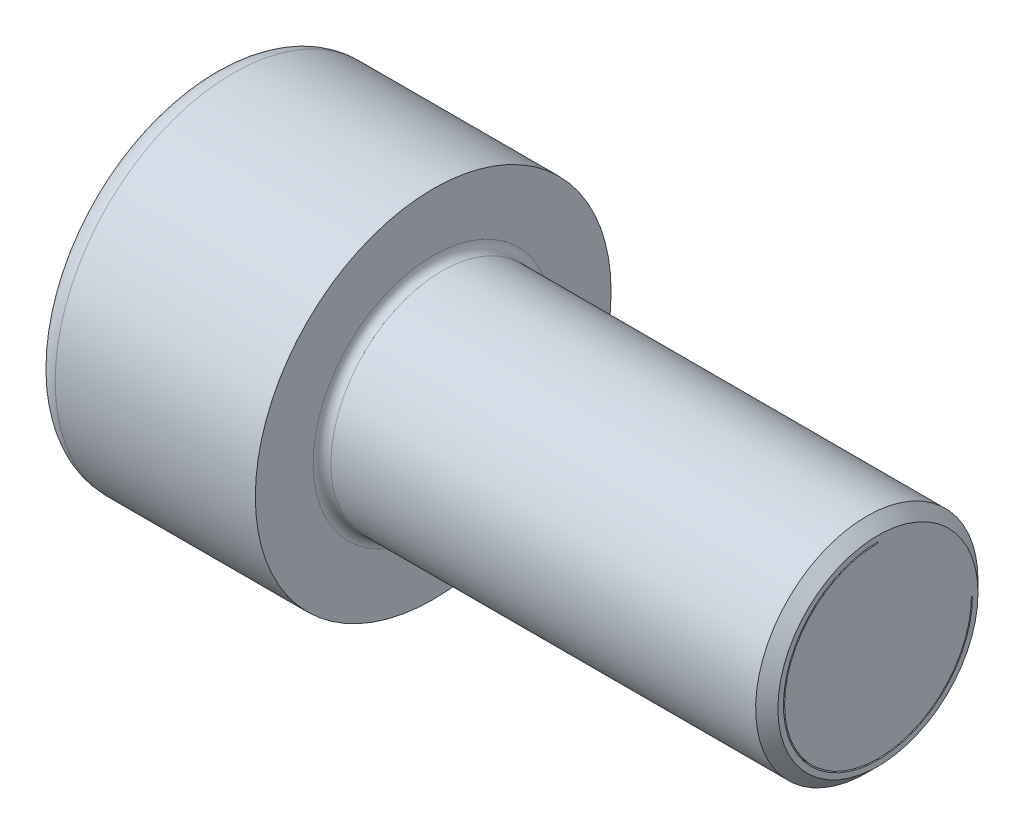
ISO-10303-21;
HEADER;
FILE_DESCRIPTION(('STEP AP214'),'2;1');
FILE_NAME('part.step','',(''),(''),'','','');
FILE_SCHEMA(('AUTOMOTIVE_DESIGN { 1 0 10303 214 1 1 1 1 }'));
ENDSEC;
DATA;
#1=APPLICATION_CONTEXT('core data for automotive mechanical design processes');
#2=APPLICATION_PROTOCOL_DEFINITION('international standard','automotive_design',2000,#1);
#3=PRODUCT_CONTEXT('',#1,'mechanical');
#4=PRODUCT('Part','Part','',(#3));
#5=PRODUCT_RELATED_PRODUCT_CATEGORY('part','',(#4));
#6=PRODUCT_DEFINITION_FORMATION('','',#4);
#7=PRODUCT_DEFINITION_CONTEXT('part definition',#1,'design');
#8=PRODUCT_DEFINITION('design','',#6,#7);
#9=PRODUCT_DEFINITION_SHAPE('','',#8);
#10=(LENGTH_UNIT() NAMED_UNIT(*) SI_UNIT(.MILLI.,.METRE.));
#11=(NAMED_UNIT(*) PLANE_ANGLE_UNIT() SI_UNIT($,.RADIAN.));
#12=(NAMED_UNIT(*) SI_UNIT($,.STERADIAN.) SOLID_ANGLE_UNIT());
#13=UNCERTAINTY_MEASURE_WITH_UNIT(LENGTH_MEASURE(1.E-05),#10,'distance_accuracy_value','');
#14=(GEOMETRIC_REPRESENTATION_CONTEXT(3) GLOBAL_UNCERTAINTY_ASSIGNED_CONTEXT((#13)) GLOBAL_UNIT_ASSIGNED_CONTEXT((#10,
#11,#12)) REPRESENTATION_CONTEXT('',''));
#15=CARTESIAN_POINT('',(0.,0.,0.));
#16=DIRECTION('',(0.,0.,1.));
#17=DIRECTION('',(1.,0.,0.));
#18=AXIS2_PLACEMENT_3D('',#15,#16,#17);
#19=CARTESIAN_POINT('',(4.5,2.50000000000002,0.));
#20=DIRECTION('',(1.,0.,0.));
#21=DIRECTION('',(0.,0.,-0.999999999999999));
#22=AXIS2_PLACEMENT_3D('',#19,#20,#21);
#23=PLANE('',#22);
#24=CARTESIAN_POINT('',(4.5,0.,0.));
#25=DIRECTION('',(-1.,0.,0.));
#26=DIRECTION('',(0.,0.999999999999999,0.));
#27=AXIS2_PLACEMENT_3D('',#24,#25,#26);
#28=CIRCLE('',#27,4.2);
#29=CARTESIAN_POINT('',(4.5,0.,-4.19999999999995));
#30=VERTEX_POINT('',#29);
#31=CARTESIAN_POINT('',(4.5,4.2,0.));
#32=VERTEX_POINT('',#31);
#33=EDGE_CURVE('E57',#30,#32,#28,.T.);
#34=ORIENTED_EDGE('',*,*,#33,.T.);
#35=DIRECTION('',(0.,0.999999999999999,0.));
#36=VECTOR('',#35,1.);
#37=CARTESIAN_POINT('',(4.5,3.36250000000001,0.));
#38=LINE('',#37,#36);
#39=CARTESIAN_POINT('',(4.5,4.25000000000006,0.));
#40=VERTEX_POINT('',#39);
#41=EDGE_CURVE('E256',#32,#40,#38,.T.);
#42=ORIENTED_EDGE('',*,*,#41,.T.);
#43=CARTESIAN_POINT('',(4.5,0.,0.));
#44=DIRECTION('',(1.,0.,0.));
#45=DIRECTION('',(0.,0.999999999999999,0.));
#46=AXIS2_PLACEMENT_3D('',#43,#44,#45);
#47=CIRCLE('',#46,4.25);
#48=CARTESIAN_POINT('',(4.5,0.,-4.25));
#49=VERTEX_POINT('',#48);
#50=EDGE_CURVE('E260',#40,#49,#47,.T.);
#51=ORIENTED_EDGE('',*,*,#50,.T.);
#52=DIRECTION('',(0.,0.,1.));
#53=VECTOR('',#52,1.);
#54=CARTESIAN_POINT('',(4.5,0.,-2.11249999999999));
#55=LINE('',#54,#53);
#56=EDGE_CURVE('E136',#49,#30,#55,.T.);
#57=ORIENTED_EDGE('',*,*,#56,.T.);
#58=EDGE_LOOP('',(#34,#42,#51,#57));
#59=FACE_BOUND('',#58,.T.);
#60=ADVANCED_FACE('F40',(#59),#23,.T.);
#61=CARTESIAN_POINT('',(2.45000000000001,0.,0.));
#62=DIRECTION('',(-1.,0.,0.));
#63=DIRECTION('',(0.,0.,0.999999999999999));
#64=AXIS2_PLACEMENT_3D('',#61,#62,#63);
#65=CYLINDRICAL_SURFACE('',#64,5.);
#66=CARTESIAN_POINT('',(19.5,0.,0.));
#67=DIRECTION('',(1.,0.,0.));
#68=DIRECTION('',(0.,0.,-0.999999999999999));
#69=AXIS2_PLACEMENT_3D('',#66,#67,#68);
#70=CIRCLE('',#69,5.);
#71=CARTESIAN_POINT('',(19.5,0.,-5.));
#72=VERTEX_POINT('',#71);
#73=EDGE_CURVE('E11',#72,#72,#70,.F.);
#74=ORIENTED_EDGE('',*,*,#73,.T.);
#75=EDGE_LOOP('',(#74));
#76=FACE_BOUND('',#75,.T.);
#77=CARTESIAN_POINT('',(0.400000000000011,0.,0.));
#78=DIRECTION('',(1.,0.,0.));
#79=DIRECTION('',(0.,0.999999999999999,0.));
#80=AXIS2_PLACEMENT_3D('',#77,#78,#79);
#81=CIRCLE('',#80,5.);
#82=CARTESIAN_POINT('',(0.400000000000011,5.,0.));
#83=VERTEX_POINT('',#82);
#84=EDGE_CURVE('E317',#83,#83,#81,.T.);
#85=ORIENTED_EDGE('',*,*,#84,.T.);
#86=EDGE_LOOP('',(#85));
#87=FACE_BOUND('',#86,.T.);
#88=ADVANCED_FACE('F179',(#76,#87),#65,.T.);
#89=CARTESIAN_POINT('',(0.400000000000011,0.,0.));
#90=DIRECTION('',(1.,0.,0.));
#91=DIRECTION('',(0.,0.,-1.));
#92=AXIS2_PLACEMENT_3D('',#89,#90,#91);
#93=TOROIDAL_SURFACE('',#92,5.39999999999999,0.4);
#94=CARTESIAN_POINT('',(0.,0.,0.));
#95=DIRECTION('',(1.,0.,0.));
#96=DIRECTION('',(0.,0.999999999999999,0.));
#97=AXIS2_PLACEMENT_3D('',#94,#95,#96);
#98=CIRCLE('',#97,5.4);
#99=CARTESIAN_POINT('',(0.,5.4,0.));
#100=VERTEX_POINT('',#99);
#101=EDGE_CURVE('E285',#100,#100,#98,.T.);
#102=ORIENTED_EDGE('',*,*,#101,.T.);
#103=EDGE_LOOP('',(#102));
#104=FACE_BOUND('',#103,.T.);
#105=ORIENTED_EDGE('',*,*,#84,.F.);
#106=EDGE_LOOP('',(#105));
#107=FACE_BOUND('',#106,.T.);
#108=ADVANCED_FACE('F174',(#104,#107),#93,.F.);
#109=CARTESIAN_POINT('',(0.,6.7,0.));
#110=DIRECTION('',(1.,0.,0.));
#111=DIRECTION('',(0.,0.,-0.999999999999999));
#112=AXIS2_PLACEMENT_3D('',#109,#110,#111);
#113=PLANE('',#112);
#114=CARTESIAN_POINT('',(0.,0.,0.));
#115=DIRECTION('',(1.,0.,0.));
#116=DIRECTION('',(0.,0.999999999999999,0.));
#117=AXIS2_PLACEMENT_3D('',#114,#115,#116);
#118=CIRCLE('',#117,8.);
#119=CARTESIAN_POINT('',(0.,7.99999999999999,0.));
#120=VERTEX_POINT('',#119);
#121=EDGE_CURVE('E321',#120,#120,#118,.T.);
#122=ORIENTED_EDGE('',*,*,#121,.T.);
#123=EDGE_LOOP('',(#122));
#124=FACE_BOUND('',#123,.T.);
#125=ORIENTED_EDGE('',*,*,#101,.F.);
#126=EDGE_LOOP('',(#125));
#127=FACE_BOUND('',#126,.T.);
#128=ADVANCED_FACE('F178',(#124,#127),#113,.T.);
#129=CARTESIAN_POINT('',(-4.5,0.,0.));
#130=DIRECTION('',(-1.,0.,0.));
#131=DIRECTION('',(0.,0.,0.999999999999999));
#132=AXIS2_PLACEMENT_3D('',#129,#130,#131);
#133=CYLINDRICAL_SURFACE('',#132,8.);
#134=CARTESIAN_POINT('',(-9.00000000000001,0.,0.));
#135=DIRECTION('',(1.,0.,0.));
#136=DIRECTION('',(0.,0.999999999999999,0.));
#137=AXIS2_PLACEMENT_3D('',#134,#135,#136);
#138=CIRCLE('',#137,8.);
#139=CARTESIAN_POINT('',(-9.00000000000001,7.99999999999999,0.));
#140=VERTEX_POINT('',#139);
#141=EDGE_CURVE('E323',#140,#140,#138,.T.);
#142=ORIENTED_EDGE('',*,*,#141,.T.);
#143=EDGE_LOOP('',(#142));
#144=FACE_BOUND('',#143,.T.);
#145=ORIENTED_EDGE('',*,*,#121,.F.);
#146=EDGE_LOOP('',(#145));
#147=FACE_BOUND('',#146,.T.);
#148=ADVANCED_FACE('F184',(#144,#147),#133,.T.);
#149=CARTESIAN_POINT('',(-9.00000000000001,0.,0.));
#150=DIRECTION('',(1.,0.,0.));
#151=DIRECTION('',(0.,0.,-1.));
#152=AXIS2_PLACEMENT_3D('',#149,#150,#151);
#153=TOROIDAL_SURFACE('',#152,6.99999999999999,1.);
#154=CARTESIAN_POINT('',(-10.,0.,0.));
#155=DIRECTION('',(1.,0.,0.));
#156=DIRECTION('',(0.,0.999999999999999,0.));
#157=AXIS2_PLACEMENT_3D('',#154,#155,#156);
#158=CIRCLE('',#157,7.);
#159=CARTESIAN_POINT('',(-10.,7.,0.));
#160=VERTEX_POINT('',#159);
#161=EDGE_CURVE('E288',#160,#160,#158,.T.);
#162=ORIENTED_EDGE('',*,*,#161,.T.);
#163=EDGE_LOOP('',(#162));
#164=FACE_BOUND('',#163,.T.);
#165=ORIENTED_EDGE('',*,*,#141,.F.);
#166=EDGE_LOOP('',(#165));
#167=FACE_BOUND('',#166,.T.);
#168=ADVANCED_FACE('F188',(#164,#167),#153,.T.);
#169=CARTESIAN_POINT('',(-10.,3.5,0.));
#170=DIRECTION('',(-1.,0.,0.));
#171=DIRECTION('',(0.,0.,0.999999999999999));
#172=AXIS2_PLACEMENT_3D('',#169,#170,#171);
#173=PLANE('',#172);
#174=ORIENTED_EDGE('',*,*,#161,.F.);
#175=EDGE_LOOP('',(#174));
#176=FACE_BOUND('',#175,.T.);
#177=DIRECTION('',(0.,-0.5,-0.866025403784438));
#178=VECTOR('',#177,1.);
#179=CARTESIAN_POINT('',(-10.,-2.44925134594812,3.75777222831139));
#180=LINE('',#179,#178);
#181=CARTESIAN_POINT('',(-10.,-2.30940107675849,4.));
#182=VERTEX_POINT('',#181);
#183=CARTESIAN_POINT('',(-10.,-4.61880215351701,0.));
#184=VERTEX_POINT('',#183);
#185=EDGE_CURVE('E163',#182,#184,#180,.T.);
#186=ORIENTED_EDGE('',*,*,#185,.T.);
#187=DIRECTION('',(0.,0.5,-0.866025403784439));
#188=VECTOR('',#187,1.);
#189=CARTESIAN_POINT('',(-10.,-3.60395188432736,-1.75777222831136));
#190=LINE('',#189,#188);
#191=CARTESIAN_POINT('',(-10.,-2.30940107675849,-4.));
#192=VERTEX_POINT('',#191);
#193=EDGE_CURVE('E159',#184,#192,#190,.T.);
#194=ORIENTED_EDGE('',*,*,#193,.T.);
#195=DIRECTION('',(0.,0.999999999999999,0.));
#196=VECTOR('',#195,1.);
#197=CARTESIAN_POINT('',(-10.,0.595299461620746,-4.00000000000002));
#198=LINE('',#197,#196);
#199=CARTESIAN_POINT('',(-10.,2.30940107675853,-3.99999999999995));
#200=VERTEX_POINT('',#199);
#201=EDGE_CURVE('E164',#192,#200,#198,.T.);
#202=ORIENTED_EDGE('',*,*,#201,.T.);
#203=DIRECTION('',(0.,0.5,0.866025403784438));
#204=VECTOR('',#203,1.);
#205=CARTESIAN_POINT('',(-10.,3.32425134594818,-2.24222777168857));
#206=LINE('',#205,#204);
#207=CARTESIAN_POINT('',(-10.,4.618802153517,0.));
#208=VERTEX_POINT('',#207);
#209=EDGE_CURVE('E165',#200,#208,#206,.T.);
#210=ORIENTED_EDGE('',*,*,#209,.T.);
#211=DIRECTION('',(0.,-0.5,0.866025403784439));
#212=VECTOR('',#211,1.);
#213=CARTESIAN_POINT('',(-10.,4.47895188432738,0.242227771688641));
#214=LINE('',#213,#212);
#215=CARTESIAN_POINT('',(-10.,2.30940107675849,4.00000000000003));
#216=VERTEX_POINT('',#215);
#217=EDGE_CURVE('E169',#208,#216,#214,.T.);
#218=ORIENTED_EDGE('',*,*,#217,.T.);
#219=DIRECTION('',(0.,-0.999999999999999,0.));
#220=VECTOR('',#219,1.);
#221=CARTESIAN_POINT('',(-10.,2.90470053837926,4.));
#222=LINE('',#221,#220);
#223=EDGE_CURVE('E301',#216,#182,#222,.T.);
#224=ORIENTED_EDGE('',*,*,#223,.T.);
#225=EDGE_LOOP('',(#186,#194,#202,#210,#218,#224));
#226=FACE_BOUND('',#225,.T.);
#227=ADVANCED_FACE('F192',(#176,#226),#173,.T.);
#228=CARTESIAN_POINT('',(-5.,0.,0.));
#229=DIRECTION('',(-1.,0.,0.));
#230=DIRECTION('',(0.,0.,0.999999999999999));
#231=AXIS2_PLACEMENT_3D('',#228,#229,#230);
#232=PLANE('',#231);
#233=DIRECTION('',(0.,0.999999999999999,0.));
#234=VECTOR('',#233,1.);
#235=CARTESIAN_POINT('',(-5.,-2.30940107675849,4.));
#236=LINE('',#235,#234);
#237=CARTESIAN_POINT('',(-5.,-2.30940107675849,4.));
#238=VERTEX_POINT('',#237);
#239=CARTESIAN_POINT('',(-5.,2.30940107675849,4.00000000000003));
#240=VERTEX_POINT('',#239);
#241=EDGE_CURVE('E274',#238,#240,#236,.T.);
#242=ORIENTED_EDGE('',*,*,#241,.T.);
#243=DIRECTION('',(0.,0.5,-0.866025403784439));
#244=VECTOR('',#243,1.);
#245=CARTESIAN_POINT('',(-5.,2.30940107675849,4.00000000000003));
#246=LINE('',#245,#244);
#247=CARTESIAN_POINT('',(-5.,4.618802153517,0.));
#248=VERTEX_POINT('',#247);
#249=EDGE_CURVE('E267',#240,#248,#246,.T.);
#250=ORIENTED_EDGE('',*,*,#249,.T.);
#251=DIRECTION('',(0.,-0.5,-0.866025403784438));
#252=VECTOR('',#251,1.);
#253=CARTESIAN_POINT('',(-5.,4.618802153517,0.));
#254=LINE('',#253,#252);
#255=CARTESIAN_POINT('',(-5.,2.30940107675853,-3.99999999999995));
#256=VERTEX_POINT('',#255);
#257=EDGE_CURVE('E264',#248,#256,#254,.T.);
#258=ORIENTED_EDGE('',*,*,#257,.T.);
#259=DIRECTION('',(0.,-0.999999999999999,0.));
#260=VECTOR('',#259,1.);
#261=CARTESIAN_POINT('',(-5.,2.30940107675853,-3.99999999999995));
#262=LINE('',#261,#260);
#263=CARTESIAN_POINT('',(-5.,-2.30940107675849,-4.));
#264=VERTEX_POINT('',#263);
#265=EDGE_CURVE('E268',#256,#264,#262,.T.);
#266=ORIENTED_EDGE('',*,*,#265,.T.);
#267=DIRECTION('',(0.,-0.5,0.866025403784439));
#268=VECTOR('',#267,1.);
#269=CARTESIAN_POINT('',(-5.,-2.30940107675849,-4.));
#270=LINE('',#269,#268);
#271=CARTESIAN_POINT('',(-5.,-4.61880215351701,0.));
#272=VERTEX_POINT('',#271);
#273=EDGE_CURVE('E276',#264,#272,#270,.T.);
#274=ORIENTED_EDGE('',*,*,#273,.T.);
#275=DIRECTION('',(0.,0.5,0.866025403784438));
#276=VECTOR('',#275,1.);
#277=CARTESIAN_POINT('',(-5.,-4.61880215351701,0.));
#278=LINE('',#277,#276);
#279=EDGE_CURVE('E281',#272,#238,#278,.T.);
#280=ORIENTED_EDGE('',*,*,#279,.T.);
#281=EDGE_LOOP('',(#242,#250,#258,#266,#274,#280));
#282=FACE_BOUND('',#281,.T.);
#283=ADVANCED_FACE('F196',(#282),#232,.T.);
#284=CARTESIAN_POINT('',(-5.,-2.30940107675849,-4.));
#285=DIRECTION('',(0.,0.,0.999999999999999));
#286=DIRECTION('',(1.,0.,0.));
#287=AXIS2_PLACEMENT_3D('',#284,#285,#286);
#288=PLANE('',#287);
#289=ORIENTED_EDGE('',*,*,#201,.F.);
#290=DIRECTION('',(-1.,0.,0.));
#291=VECTOR('',#290,1.);
#292=CARTESIAN_POINT('',(-5.,-2.30940107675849,-4.));
#293=LINE('',#292,#291);
#294=EDGE_CURVE('E306',#264,#192,#293,.T.);
#295=ORIENTED_EDGE('',*,*,#294,.F.);
#296=ORIENTED_EDGE('',*,*,#265,.F.);
#297=DIRECTION('',(-1.,0.,0.));
#298=VECTOR('',#297,1.);
#299=CARTESIAN_POINT('',(-5.,2.30940107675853,-3.99999999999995));
#300=LINE('',#299,#298);
#301=EDGE_CURVE('E101',#256,#200,#300,.T.);
#302=ORIENTED_EDGE('',*,*,#301,.T.);
#303=EDGE_LOOP('',(#289,#295,#296,#302));
#304=FACE_BOUND('',#303,.T.);
#305=ADVANCED_FACE('F200',(#304),#288,.T.);
#306=CARTESIAN_POINT('',(-5.,-4.61880215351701,0.));
#307=DIRECTION('',(0.,0.866025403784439,0.5));
#308=DIRECTION('',(0.,-0.5,0.866025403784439));
#309=AXIS2_PLACEMENT_3D('',#306,#307,#308);
#310=PLANE('',#309);
#311=ORIENTED_EDGE('',*,*,#193,.F.);
#312=DIRECTION('',(-1.,0.,0.));
#313=VECTOR('',#312,1.);
#314=CARTESIAN_POINT('',(-5.,-4.61880215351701,0.));
#315=LINE('',#314,#313);
#316=EDGE_CURVE('E296',#272,#184,#315,.T.);
#317=ORIENTED_EDGE('',*,*,#316,.F.);
#318=ORIENTED_EDGE('',*,*,#273,.F.);
#319=ORIENTED_EDGE('',*,*,#294,.T.);
#320=EDGE_LOOP('',(#311,#317,#318,#319));
#321=FACE_BOUND('',#320,.T.);
#322=ADVANCED_FACE('F204',(#321),#310,.T.);
#323=CARTESIAN_POINT('',(-5.,-2.30940107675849,4.));
#324=DIRECTION('',(0.,0.866025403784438,-0.5));
#325=DIRECTION('',(0.,0.5,0.866025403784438));
#326=AXIS2_PLACEMENT_3D('',#323,#324,#325);
#327=PLANE('',#326);
#328=ORIENTED_EDGE('',*,*,#185,.F.);
#329=DIRECTION('',(-1.,0.,0.));
#330=VECTOR('',#329,1.);
#331=CARTESIAN_POINT('',(-5.,-2.30940107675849,4.));
#332=LINE('',#331,#330);
#333=EDGE_CURVE('E293',#238,#182,#332,.T.);
#334=ORIENTED_EDGE('',*,*,#333,.F.);
#335=ORIENTED_EDGE('',*,*,#279,.F.);
#336=ORIENTED_EDGE('',*,*,#316,.T.);
#337=EDGE_LOOP('',(#328,#334,#335,#336));
#338=FACE_BOUND('',#337,.T.);
#339=ADVANCED_FACE('F207',(#338),#327,.T.);
#340=CARTESIAN_POINT('',(-5.,2.30940107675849,4.00000000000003));
#341=DIRECTION('',(0.,0.,-0.999999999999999));
#342=DIRECTION('',(-1.,0.,0.));
#343=AXIS2_PLACEMENT_3D('',#340,#341,#342);
#344=PLANE('',#343);
#345=ORIENTED_EDGE('',*,*,#223,.F.);
#346=DIRECTION('',(-1.,0.,0.));
#347=VECTOR('',#346,1.);
#348=CARTESIAN_POINT('',(-5.,2.30940107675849,4.00000000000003));
#349=LINE('',#348,#347);
#350=EDGE_CURVE('E297',#240,#216,#349,.T.);
#351=ORIENTED_EDGE('',*,*,#350,.F.);
#352=ORIENTED_EDGE('',*,*,#241,.F.);
#353=ORIENTED_EDGE('',*,*,#333,.T.);
#354=EDGE_LOOP('',(#345,#351,#352,#353));
#355=FACE_BOUND('',#354,.T.);
#356=ADVANCED_FACE('F211',(#355),#344,.T.);
#357=CARTESIAN_POINT('',(-5.,4.618802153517,0.));
#358=DIRECTION('',(0.,-0.866025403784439,-0.5));
#359=DIRECTION('',(0.,0.5,-0.866025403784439));
#360=AXIS2_PLACEMENT_3D('',#357,#358,#359);
#361=PLANE('',#360);
#362=ORIENTED_EDGE('',*,*,#217,.F.);
#363=DIRECTION('',(-1.,0.,0.));
#364=VECTOR('',#363,1.);
#365=CARTESIAN_POINT('',(-5.,4.618802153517,0.));
#366=LINE('',#365,#364);
#367=EDGE_CURVE('E108',#248,#208,#366,.T.);
#368=ORIENTED_EDGE('',*,*,#367,.F.);
#369=ORIENTED_EDGE('',*,*,#249,.F.);
#370=ORIENTED_EDGE('',*,*,#350,.T.);
#371=EDGE_LOOP('',(#362,#368,#369,#370));
#372=FACE_BOUND('',#371,.T.);
#373=ADVANCED_FACE('F215',(#372),#361,.T.);
#374=CARTESIAN_POINT('',(-5.,2.30940107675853,-3.99999999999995));
#375=DIRECTION('',(0.,-0.866025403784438,0.5));
#376=DIRECTION('',(0.,-0.5,-0.866025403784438));
#377=AXIS2_PLACEMENT_3D('',#374,#375,#376);
#378=PLANE('',#377);
#379=ORIENTED_EDGE('',*,*,#209,.F.);
#380=ORIENTED_EDGE('',*,*,#301,.F.);
#381=ORIENTED_EDGE('',*,*,#257,.F.);
#382=ORIENTED_EDGE('',*,*,#367,.T.);
#383=EDGE_LOOP('',(#379,#380,#381,#382));
#384=FACE_BOUND('',#383,.T.);
#385=ADVANCED_FACE('F219',(#384),#378,.T.);
#386=CARTESIAN_POINT('',(20.,0.,0.));
#387=DIRECTION('',(1.,0.,0.));
#388=DIRECTION('',(0.,0.,-0.999999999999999));
#389=AXIS2_PLACEMENT_3D('',#386,#387,#388);
#390=PLANE('',#389);
#391=CARTESIAN_POINT('',(20.,0.,0.));
#392=DIRECTION('',(1.,0.,0.));
#393=DIRECTION('',(0.,0.,-0.999999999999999));
#394=AXIS2_PLACEMENT_3D('',#391,#392,#393);
#395=CIRCLE('',#394,4.5);
#396=CARTESIAN_POINT('',(20.,0.,-4.5));
#397=VERTEX_POINT('',#396);
#398=EDGE_CURVE('E50',#397,#397,#395,.T.);
#399=ORIENTED_EDGE('',*,*,#398,.T.);
#400=EDGE_LOOP('',(#399));
#401=FACE_BOUND('',#400,.T.);
#402=DIRECTION('',(0.,-0.999999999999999,0.));
#403=VECTOR('',#402,1.);
#404=CARTESIAN_POINT('',(20.,2.11250000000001,0.));
#405=LINE('',#404,#403);
#406=CARTESIAN_POINT('',(20.,4.25000000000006,0.));
#407=VERTEX_POINT('',#406);
#408=CARTESIAN_POINT('',(20.,4.2,0.));
#409=VERTEX_POINT('',#408);
#410=EDGE_CURVE('E139',#407,#409,#405,.T.);
#411=ORIENTED_EDGE('',*,*,#410,.T.);
#412=CARTESIAN_POINT('',(20.,0.,0.));
#413=DIRECTION('',(1.,0.,0.));
#414=DIRECTION('',(0.,0.999999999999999,0.));
#415=AXIS2_PLACEMENT_3D('',#412,#413,#414);
#416=CIRCLE('',#415,4.2);
#417=CARTESIAN_POINT('',(20.,0.,-4.19999999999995));
#418=VERTEX_POINT('',#417);
#419=EDGE_CURVE('E149',#409,#418,#416,.T.);
#420=ORIENTED_EDGE('',*,*,#419,.T.);
#421=DIRECTION('',(0.,0.,-1.));
#422=VECTOR('',#421,1.);
#423=CARTESIAN_POINT('',(20.,0.,-2.11249999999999));
#424=LINE('',#423,#422);
#425=CARTESIAN_POINT('',(20.,0.,-4.25));
#426=VERTEX_POINT('',#425);
#427=EDGE_CURVE('E135',#418,#426,#424,.T.);
#428=ORIENTED_EDGE('',*,*,#427,.T.);
#429=CARTESIAN_POINT('',(20.,0.,0.));
#430=DIRECTION('',(-1.,0.,0.));
#431=DIRECTION('',(0.,0.999999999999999,0.));
#432=AXIS2_PLACEMENT_3D('',#429,#430,#431);
#433=CIRCLE('',#432,4.25);
#434=EDGE_CURVE('E126',#426,#407,#433,.T.);
#435=ORIENTED_EDGE('',*,*,#434,.T.);
#436=EDGE_LOOP('',(#411,#420,#428,#435));
#437=FACE_BOUND('',#436,.T.);
#438=ADVANCED_FACE('F148',(#401,#437),#390,.T.);
#439=CARTESIAN_POINT('',(12.25,0.,-4.22499999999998));
#440=DIRECTION('',(0.,-1.,0.));
#441=DIRECTION('',(0.,0.,-1.));
#442=AXIS2_PLACEMENT_3D('',#439,#440,#441);
#443=PLANE('',#442);
#444=DIRECTION('',(1.,0.,0.));
#445=VECTOR('',#444,1.);
#446=CARTESIAN_POINT('',(20.,0.,-4.25));
#447=LINE('',#446,#445);
#448=EDGE_CURVE('E133',#49,#426,#447,.T.);
#449=ORIENTED_EDGE('',*,*,#448,.T.);
#450=ORIENTED_EDGE('',*,*,#427,.F.);
#451=DIRECTION('',(-1.,0.,0.));
#452=VECTOR('',#451,1.);
#453=CARTESIAN_POINT('',(4.5,0.,-4.19999999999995));
#454=LINE('',#453,#452);
#455=EDGE_CURVE('E140',#418,#30,#454,.T.);
#456=ORIENTED_EDGE('',*,*,#455,.T.);
#457=ORIENTED_EDGE('',*,*,#56,.F.);
#458=EDGE_LOOP('',(#449,#450,#456,#457));
#459=FACE_BOUND('',#458,.T.);
#460=ADVANCED_FACE('F134',(#459),#443,.T.);
#461=CARTESIAN_POINT('',(12.25,4.225,0.));
#462=DIRECTION('',(0.,0.,0.999999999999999));
#463=DIRECTION('',(1.,0.,0.));
#464=AXIS2_PLACEMENT_3D('',#461,#462,#463);
#465=PLANE('',#464);
#466=ORIENTED_EDGE('',*,*,#41,.F.);
#467=DIRECTION('',(1.,0.,0.));
#468=VECTOR('',#467,1.);
#469=CARTESIAN_POINT('',(4.5,4.2,0.));
#470=LINE('',#469,#468);
#471=EDGE_CURVE('E292',#32,#409,#470,.T.);
#472=ORIENTED_EDGE('',*,*,#471,.T.);
#473=ORIENTED_EDGE('',*,*,#410,.F.);
#474=DIRECTION('',(-1.,0.,0.));
#475=VECTOR('',#474,1.);
#476=CARTESIAN_POINT('',(20.,4.25000000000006,0.));
#477=LINE('',#476,#475);
#478=EDGE_CURVE('E143',#407,#40,#477,.T.);
#479=ORIENTED_EDGE('',*,*,#478,.T.);
#480=EDGE_LOOP('',(#466,#472,#473,#479));
#481=FACE_BOUND('',#480,.T.);
#482=ADVANCED_FACE('F228',(#481),#465,.T.);
#483=CARTESIAN_POINT('',(12.25,0.,0.));
#484=DIRECTION('',(-1.,0.,0.));
#485=DIRECTION('',(0.,0.,0.999999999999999));
#486=AXIS2_PLACEMENT_3D('',#483,#484,#485);
#487=CYLINDRICAL_SURFACE('',#486,4.2);
#488=ORIENTED_EDGE('',*,*,#471,.F.);
#489=ORIENTED_EDGE('',*,*,#33,.F.);
#490=ORIENTED_EDGE('',*,*,#455,.F.);
#491=ORIENTED_EDGE('',*,*,#419,.F.);
#492=EDGE_LOOP('',(#488,#489,#490,#491));
#493=FACE_BOUND('',#492,.T.);
#494=ADVANCED_FACE('F230',(#493),#487,.T.);
#495=CARTESIAN_POINT('',(12.25,0.,0.));
#496=DIRECTION('',(-1.,0.,0.));
#497=DIRECTION('',(0.,0.,0.999999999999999));
#498=AXIS2_PLACEMENT_3D('',#495,#496,#497);
#499=CYLINDRICAL_SURFACE('',#498,4.25);
#500=ORIENTED_EDGE('',*,*,#448,.F.);
#501=ORIENTED_EDGE('',*,*,#50,.F.);
#502=ORIENTED_EDGE('',*,*,#478,.F.);
#503=ORIENTED_EDGE('',*,*,#434,.F.);
#504=EDGE_LOOP('',(#500,#501,#502,#503));
#505=FACE_BOUND('',#504,.T.);
#506=ADVANCED_FACE('F42',(#505),#499,.F.);
#507=CARTESIAN_POINT('',(20.,0.,0.));
#508=DIRECTION('',(-1.,0.,0.));
#509=DIRECTION('',(0.,0.,0.999999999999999));
#510=AXIS2_PLACEMENT_3D('',#507,#508,#509);
#511=CONICAL_SURFACE('',#510,4.5,0.785398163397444);
#512=ORIENTED_EDGE('',*,*,#73,.F.);
#513=EDGE_LOOP('',(#512));
#514=FACE_BOUND('',#513,.T.);
#515=ORIENTED_EDGE('',*,*,#398,.F.);
#516=EDGE_LOOP('',(#515));
#517=FACE_BOUND('',#516,.T.);
#518=ADVANCED_FACE('F237',(#514,#517),#511,.T.);
#519=CLOSED_SHELL('',(#60,#88,#108,#128,#148,#168,#227,#283,#305,#322,#339,#356,#373,#385,#438,
#460,#482,#494,#506,#518));
#520=MANIFOLD_SOLID_BREP('B2',#519);
#521=ADVANCED_BREP_SHAPE_REPRESENTATION('',(#18,#520),#14);
#522=SHAPE_DEFINITION_REPRESENTATION(#9,#521);
ENDSEC;
END-ISO-10303-21;
